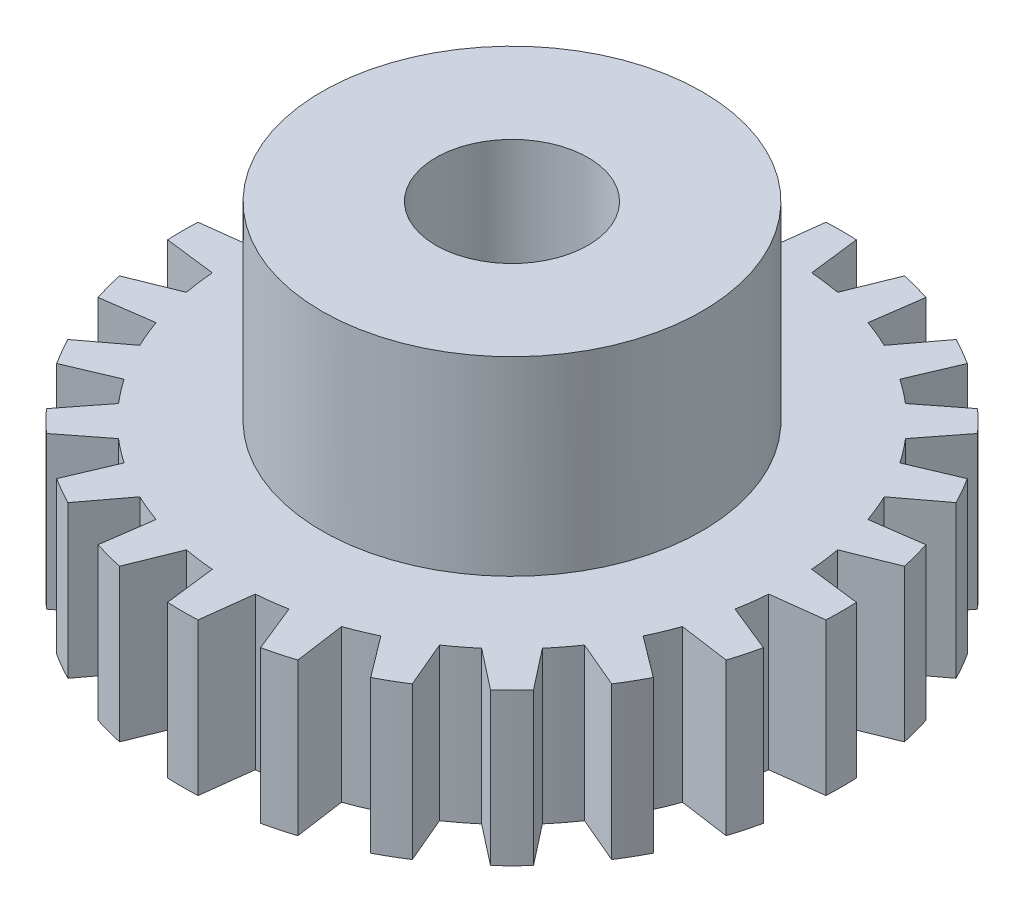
from build123d import *

# Parameters (mm, degrees)
SKETCH1_R           = 3.175
BOSS_EXTRUDE1_DEPTH = 6.35
SKETCH2_R           = 7.9375
SKETCH2_R_2         = 3.175
BOSS_EXTRUDE2_DEPTH = 7.9375


with BuildPart() as part:
    # Sketch1 → Boss-Extrude1 (new body)
    with BuildSketch(Plane(origin=(0, 0, 0), x_dir=(1, 0, 0), z_dir=(0, 1, 0))):
        with BuildLine():
            Line((-0.635, 13.739433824), (-0.896294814, 11.611358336))
            ThreePointArc((-0.896294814, 11.611358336), (-1.520094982, 11.546267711), (-2.139486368, 11.447689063))
            Line((-2.139486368, 11.447689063), (-2.942664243, 13.435624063))
            ThreePointArc((-2.942664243, 13.435624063), (-3.559823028, 13.285440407), (-4.169390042, 13.106923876))
            Line((-4.169390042, 13.106923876), (-3.870994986, 10.983732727))
            ThreePointArc((-3.870994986, 10.983732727), (-4.456692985, 10.759408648), (-5.02946509, 10.503878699))
            Line((-5.02946509, 10.503878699), (-6.319790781, 12.216198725))
            ThreePointArc((-6.319790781, 12.216198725), (-6.87705, 11.911400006), (-7.419643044, 11.581198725))
            Line((-7.419643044, 11.581198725), (-6.581893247, 9.607583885))
            ThreePointArc((-6.581893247, 9.607583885), (-7.089574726, 9.239313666), (-7.576694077, 8.84424636))
            Line((-7.576694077, 8.84424636), (-9.266234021, 10.164259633))
            ThreePointArc((-9.266234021, 10.164259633), (-9.725617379, 9.725617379), (-10.164259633, 9.266234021))
            Line((-10.164259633, 9.266234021), (-8.84424636, 7.576694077))
            ThreePointArc((-8.84424636, 7.576694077), (-9.239313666, 7.089574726), (-9.607583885, 6.581893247))
            Line((-9.607583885, 6.581893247), (-11.581198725, 7.419643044))
            ThreePointArc((-11.581198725, 7.419643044), (-11.911400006, 6.87705), (-12.216198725, 6.319790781))
            Line((-12.216198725, 6.319790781), (-10.503878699, 5.02946509))
            ThreePointArc((-10.503878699, 5.02946509), (-10.759408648, 4.456692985), (-10.983732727, 3.870994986))
            Line((-10.983732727, 3.870994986), (-13.106923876, 4.169390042))
            ThreePointArc((-13.106923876, 4.169390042), (-13.285440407, 3.559823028), (-13.435624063, 2.942664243))
            Line((-13.435624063, 2.942664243), (-11.447689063, 2.139486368))
            ThreePointArc((-11.447689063, 2.139486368), (-11.546267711, 1.520094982), (-11.611358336, 0.896294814))
            Line((-11.611358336, 0.896294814), (-13.739433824, 0.635))
            ThreePointArc((-13.739433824, 0.635), (-13.7541, 0), (-13.739433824, -0.635))
            Line((-13.739433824, -0.635), (-11.611358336, -0.896294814))
            ThreePointArc((-11.611358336, -0.896294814), (-11.546267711, -1.520094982), (-11.447689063, -2.139486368))
            Line((-11.447689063, -2.139486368), (-13.435624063, -2.942664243))
            ThreePointArc((-13.435624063, -2.942664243), (-13.285440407, -3.559823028), (-13.106923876, -4.169390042))
            Line((-13.106923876, -4.169390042), (-10.983732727, -3.870994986))
            ThreePointArc((-10.983732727, -3.870994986), (-10.759408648, -4.456692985), (-10.503878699, -5.02946509))
            Line((-10.503878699, -5.02946509), (-12.216198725, -6.319790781))
            ThreePointArc((-12.216198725, -6.319790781), (-11.911400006, -6.87705), (-11.581198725, -7.419643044))
            Line((-11.581198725, -7.419643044), (-9.607583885, -6.581893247))
            ThreePointArc((-9.607583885, -6.581893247), (-9.239313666, -7.089574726), (-8.84424636, -7.576694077))
            Line((-8.84424636, -7.576694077), (-10.164259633, -9.266234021))
            ThreePointArc((-10.164259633, -9.266234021), (-9.725617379, -9.725617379), (-9.266234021, -10.164259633))
            Line((-9.266234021, -10.164259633), (-7.576694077, -8.84424636))
            ThreePointArc((-7.576694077, -8.84424636), (-7.089574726, -9.239313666), (-6.581893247, -9.607583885))
            Line((-6.581893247, -9.607583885), (-7.419643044, -11.581198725))
            ThreePointArc((-7.419643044, -11.581198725), (-6.87705, -11.911400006), (-6.319790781, -12.216198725))
            Line((-6.319790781, -12.216198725), (-5.02946509, -10.503878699))
            ThreePointArc((-5.02946509, -10.503878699), (-4.456692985, -10.759408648), (-3.870994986, -10.983732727))
            Line((-3.870994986, -10.983732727), (-4.169390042, -13.106923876))
            ThreePointArc((-4.169390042, -13.106923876), (-3.559823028, -13.285440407), (-2.942664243, -13.435624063))
            Line((-2.942664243, -13.435624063), (-2.139486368, -11.447689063))
            ThreePointArc((-2.139486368, -11.447689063), (-1.520094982, -11.546267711), (-0.896294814, -11.611358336))
            Line((-0.896294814, -11.611358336), (-0.635, -13.739433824))
            ThreePointArc((-0.635, -13.739433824), (0, -13.7541), (0.635, -13.739433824))
            Line((0.635, -13.739433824), (0.896294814, -11.611358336))
            ThreePointArc((0.896294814, -11.611358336), (1.520094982, -11.546267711), (2.139486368, -11.447689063))
            Line((2.139486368, -11.447689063), (2.942664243, -13.435624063))
            ThreePointArc((2.942664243, -13.435624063), (3.559823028, -13.285440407), (4.169390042, -13.106923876))
            Line((4.169390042, -13.106923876), (3.870994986, -10.983732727))
            ThreePointArc((3.870994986, -10.983732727), (4.456692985, -10.759408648), (5.02946509, -10.503878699))
            Line((5.02946509, -10.503878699), (6.319790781, -12.216198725))
            ThreePointArc((6.319790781, -12.216198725), (6.87705, -11.911400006), (7.419643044, -11.581198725))
            Line((7.419643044, -11.581198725), (6.581893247, -9.607583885))
            ThreePointArc((6.581893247, -9.607583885), (7.089574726, -9.239313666), (7.576694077, -8.84424636))
            Line((7.576694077, -8.84424636), (9.266234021, -10.164259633))
            ThreePointArc((9.266234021, -10.164259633), (9.725617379, -9.725617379), (10.164259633, -9.266234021))
            Line((10.164259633, -9.266234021), (8.84424636, -7.576694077))
            ThreePointArc((8.84424636, -7.576694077), (9.239313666, -7.089574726), (9.607583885, -6.581893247))
            Line((9.607583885, -6.581893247), (11.581198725, -7.419643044))
            ThreePointArc((11.581198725, -7.419643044), (11.911400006, -6.87705), (12.216198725, -6.319790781))
            Line((12.216198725, -6.319790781), (10.503878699, -5.02946509))
            ThreePointArc((10.503878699, -5.02946509), (10.759408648, -4.456692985), (10.983732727, -3.870994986))
            Line((10.983732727, -3.870994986), (13.106923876, -4.169390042))
            ThreePointArc((13.106923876, -4.169390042), (13.285440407, -3.559823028), (13.435624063, -2.942664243))
            Line((13.435624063, -2.942664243), (11.447689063, -2.139486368))
            ThreePointArc((11.447689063, -2.139486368), (11.546267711, -1.520094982), (11.611358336, -0.896294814))
            Line((11.611358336, -0.896294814), (13.739433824, -0.635))
            ThreePointArc((13.739433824, -0.635), (13.7541, 0), (13.739433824, 0.635))
            Line((13.739433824, 0.635), (11.611358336, 0.896294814))
            ThreePointArc((11.611358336, 0.896294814), (11.546267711, 1.520094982), (11.447689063, 2.139486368))
            Line((11.447689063, 2.139486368), (13.435624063, 2.942664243))
            ThreePointArc((13.435624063, 2.942664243), (13.285440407, 3.559823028), (13.106923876, 4.169390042))
            Line((13.106923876, 4.169390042), (10.983732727, 3.870994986))
            ThreePointArc((10.983732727, 3.870994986), (10.759408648, 4.456692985), (10.503878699, 5.02946509))
            Line((10.503878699, 5.02946509), (12.216198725, 6.319790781))
            ThreePointArc((12.216198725, 6.319790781), (11.911400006, 6.87705), (11.581198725, 7.419643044))
            Line((11.581198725, 7.419643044), (9.607583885, 6.581893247))
            ThreePointArc((9.607583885, 6.581893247), (9.239313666, 7.089574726), (8.84424636, 7.576694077))
            Line((8.84424636, 7.576694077), (10.164259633, 9.266234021))
            ThreePointArc((10.164259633, 9.266234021), (9.725617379, 9.725617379), (9.266234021, 10.164259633))
            Line((9.266234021, 10.164259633), (7.576694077, 8.84424636))
            ThreePointArc((7.576694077, 8.84424636), (7.089574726, 9.239313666), (6.581893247, 9.607583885))
            Line((6.581893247, 9.607583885), (7.419643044, 11.581198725))
            ThreePointArc((7.419643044, 11.581198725), (6.87705, 11.911400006), (6.319790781, 12.216198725))
            Line((6.319790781, 12.216198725), (5.02946509, 10.503878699))
            ThreePointArc((5.02946509, 10.503878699), (4.456692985, 10.759408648), (3.870994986, 10.983732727))
            Line((3.870994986, 10.983732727), (4.169390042, 13.106923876))
            ThreePointArc((4.169390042, 13.106923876), (3.559823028, 13.285440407), (2.942664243, 13.435624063))
            Line((2.942664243, 13.435624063), (2.139486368, 11.447689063))
            ThreePointArc((2.139486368, 11.447689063), (1.520094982, 11.546267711), (0.896294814, 11.611358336))
            Line((0.896294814, 11.611358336), (0.635, 13.739433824))
            ThreePointArc((0.635, 13.739433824), (0, 13.7541), (-0.635, 13.739433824))
        make_face()
        with Locations(Location((0, 0, 0), (0, 0, 270))):
            Circle(SKETCH1_R, mode=Mode.SUBTRACT)
    extrude(amount=BOSS_EXTRUDE1_DEPTH)

    # Sketch2 → Boss-Extrude2 (add)
    with BuildSketch(Plane(origin=(0, 6.35, 0), x_dir=(1, 0, 0), z_dir=(0, 1, 0))):
        with Locations(Location((0, 0, 0), (0, 0, 90))):
            Circle(SKETCH2_R)
        with Locations(Location((0, 0, 0), (0, 0, 270))):
            Circle(SKETCH2_R_2, mode=Mode.SUBTRACT)
    extrude(amount=BOSS_EXTRUDE2_DEPTH)


solid = part.part
